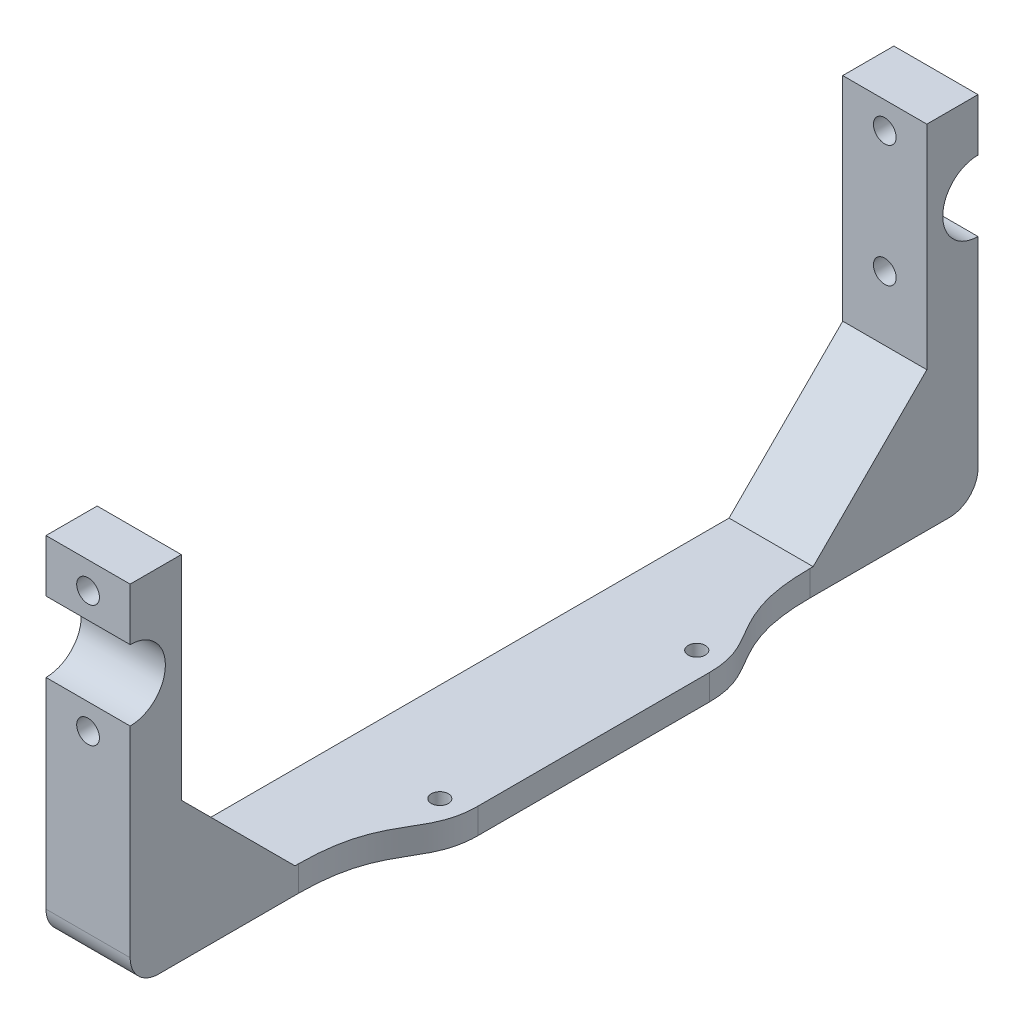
ISO-10303-21;
HEADER;
FILE_DESCRIPTION(('STEP AP214'),'2;1');
FILE_NAME('part.step','',(''),(''),'','','');
FILE_SCHEMA(('AUTOMOTIVE_DESIGN { 1 0 10303 214 1 1 1 1 }'));
ENDSEC;
DATA;
#1=APPLICATION_CONTEXT('core data for automotive mechanical design processes');
#2=APPLICATION_PROTOCOL_DEFINITION('international standard','automotive_design',2000,#1);
#3=PRODUCT_CONTEXT('',#1,'mechanical');
#4=PRODUCT('Part','Part','',(#3));
#5=PRODUCT_RELATED_PRODUCT_CATEGORY('part','',(#4));
#6=PRODUCT_DEFINITION_FORMATION('','',#4);
#7=PRODUCT_DEFINITION_CONTEXT('part definition',#1,'design');
#8=PRODUCT_DEFINITION('design','',#6,#7);
#9=PRODUCT_DEFINITION_SHAPE('','',#8);
#10=(LENGTH_UNIT() NAMED_UNIT(*) SI_UNIT(.MILLI.,.METRE.));
#11=(NAMED_UNIT(*) PLANE_ANGLE_UNIT() SI_UNIT($,.RADIAN.));
#12=(NAMED_UNIT(*) SI_UNIT($,.STERADIAN.) SOLID_ANGLE_UNIT());
#13=UNCERTAINTY_MEASURE_WITH_UNIT(LENGTH_MEASURE(1.E-05),#10,'distance_accuracy_value','');
#14=(GEOMETRIC_REPRESENTATION_CONTEXT(3) GLOBAL_UNCERTAINTY_ASSIGNED_CONTEXT((#13)) GLOBAL_UNIT_ASSIGNED_CONTEXT((#10,
#11,#12)) REPRESENTATION_CONTEXT('',''));
#15=CARTESIAN_POINT('',(0.,0.,0.));
#16=DIRECTION('',(0.,0.,1.));
#17=DIRECTION('',(1.,0.,0.));
#18=AXIS2_PLACEMENT_3D('',#15,#16,#17);
#19=CARTESIAN_POINT('',(14.8,4.5,90.));
#20=DIRECTION('',(0.,-1.,0.));
#21=DIRECTION('',(0.,0.,-1.));
#22=AXIS2_PLACEMENT_3D('',#19,#20,#21);
#23=PLANE('',#22);
#24=CARTESIAN_POINT('',(17.2994949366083,4.5,-22.6005050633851));
#25=DIRECTION('',(0.,-1.,0.));
#26=DIRECTION('',(0.,0.,-1.));
#27=AXIS2_PLACEMENT_3D('',#24,#25,#26);
#28=CIRCLE('',#27,1.50000000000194);
#29=CARTESIAN_POINT('',(17.2994949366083,4.5,-24.100505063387));
#30=VERTEX_POINT('',#29);
#31=EDGE_CURVE('E322',#30,#30,#28,.T.);
#32=ORIENTED_EDGE('',*,*,#31,.T.);
#33=EDGE_LOOP('',(#32));
#34=FACE_BOUND('',#33,.T.);
#35=CARTESIAN_POINT('',(17.2994949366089,4.5,22.6005050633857));
#36=DIRECTION('',(0.,-1.,0.));
#37=DIRECTION('',(0.,0.,-1.));
#38=AXIS2_PLACEMENT_3D('',#35,#36,#37);
#39=CIRCLE('',#38,1.50000000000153);
#40=CARTESIAN_POINT('',(17.2994949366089,4.5,21.1005050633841));
#41=VERTEX_POINT('',#40);
#42=EDGE_CURVE('E332',#41,#41,#39,.T.);
#43=ORIENTED_EDGE('',*,*,#42,.T.);
#44=EDGE_LOOP('',(#43));
#45=FACE_BOUND('',#44,.T.);
#46=DIRECTION('',(0.,0.,1.));
#47=VECTOR('',#46,1.);
#48=CARTESIAN_POINT('',(0.,4.5,90.));
#49=LINE('',#48,#47);
#50=CARTESIAN_POINT('',(0.,4.5,-45.579));
#51=VERTEX_POINT('',#50);
#52=CARTESIAN_POINT('',(0.,4.5,45.5789999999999));
#53=VERTEX_POINT('',#52);
#54=EDGE_CURVE('E346',#51,#53,#49,.T.);
#55=ORIENTED_EDGE('',*,*,#54,.T.);
#56=DIRECTION('',(1.,0.,0.));
#57=VECTOR('',#56,1.);
#58=CARTESIAN_POINT('',(14.8,4.5,45.5789999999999));
#59=LINE('',#58,#57);
#60=CARTESIAN_POINT('',(14.8,4.5,45.5789999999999));
#61=VERTEX_POINT('',#60);
#62=EDGE_CURVE('E366',#53,#61,#59,.T.);
#63=ORIENTED_EDGE('',*,*,#62,.T.);
#64=DIRECTION('',(0.,0.,1.));
#65=VECTOR('',#64,1.);
#66=CARTESIAN_POINT('',(14.8,4.5,90.));
#67=LINE('',#66,#65);
#68=CARTESIAN_POINT('',(14.8,4.5,45.));
#69=VERTEX_POINT('',#68);
#70=EDGE_CURVE('E354',#69,#61,#67,.T.);
#71=ORIENTED_EDGE('',*,*,#70,.F.);
#72=CARTESIAN_POINT('',(14.8,4.50000000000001,45.));
#73=CARTESIAN_POINT('',(14.8,4.50000000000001,29.7858355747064));
#74=CARTESIAN_POINT('',(21.8,4.50000000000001,29.7858355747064));
#75=CARTESIAN_POINT('',(21.8,4.50000000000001,20.3664277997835));
#76=B_SPLINE_CURVE_WITH_KNOTS('',3,(#72,#73,#74,#75),.UNSPECIFIED.,.F.,.F.,(4,4),(0.,1.),.UNSPECIFIED.);
#77=CARTESIAN_POINT('',(21.8,4.5,20.3664277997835));
#78=VERTEX_POINT('',#77);
#79=EDGE_CURVE('E309',#69,#78,#76,.T.);
#80=ORIENTED_EDGE('',*,*,#79,.T.);
#81=DIRECTION('',(0.,0.,1.));
#82=VECTOR('',#81,1.);
#83=CARTESIAN_POINT('',(21.8,4.5,45.));
#84=LINE('',#83,#82);
#85=CARTESIAN_POINT('',(21.8,4.5,-20.3664277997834));
#86=VERTEX_POINT('',#85);
#87=EDGE_CURVE('E339',#86,#78,#84,.T.);
#88=ORIENTED_EDGE('',*,*,#87,.F.);
#89=CARTESIAN_POINT('',(21.8,4.50000000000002,-20.3664277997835));
#90=CARTESIAN_POINT('',(21.8,4.50000000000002,-29.7858355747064));
#91=CARTESIAN_POINT('',(14.8,4.50000000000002,-29.7858355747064));
#92=CARTESIAN_POINT('',(14.8,4.50000000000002,-45.));
#93=B_SPLINE_CURVE_WITH_KNOTS('',3,(#89,#90,#91,#92),.UNSPECIFIED.,.F.,.F.,(4,4),(0.,1.),.UNSPECIFIED.);
#94=CARTESIAN_POINT('',(14.8,4.5,-45.));
#95=VERTEX_POINT('',#94);
#96=EDGE_CURVE('E312',#86,#95,#93,.T.);
#97=ORIENTED_EDGE('',*,*,#96,.T.);
#98=CARTESIAN_POINT('',(14.8,4.5,-45.579));
#99=VERTEX_POINT('',#98);
#100=EDGE_CURVE('E358',#99,#95,#67,.T.);
#101=ORIENTED_EDGE('',*,*,#100,.F.);
#102=DIRECTION('',(-1.,0.,0.));
#103=VECTOR('',#102,1.);
#104=CARTESIAN_POINT('',(14.8,4.5,-45.5790000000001));
#105=LINE('',#104,#103);
#106=EDGE_CURVE('E364',#99,#51,#105,.T.);
#107=ORIENTED_EDGE('',*,*,#106,.T.);
#108=EDGE_LOOP('',(#55,#63,#71,#80,#88,#97,#101,#107));
#109=FACE_BOUND('',#108,.T.);
#110=ADVANCED_FACE('F37',(#34,#45,#109),#23,.F.);
#111=CARTESIAN_POINT('',(14.8,0.,0.));
#112=DIRECTION('',(-1.,0.,0.));
#113=DIRECTION('',(0.,0.,1.));
#114=AXIS2_PLACEMENT_3D('',#111,#112,#113);
#115=PLANE('',#114);
#116=DIRECTION('',(0.,-1.,0.));
#117=VECTOR('',#116,1.);
#118=CARTESIAN_POINT('',(14.8,40.3,74.579));
#119=LINE('',#118,#117);
#120=CARTESIAN_POINT('',(14.8,40.3,74.579));
#121=VERTEX_POINT('',#120);
#122=CARTESIAN_POINT('',(14.8,5.,74.579));
#123=VERTEX_POINT('',#122);
#124=EDGE_CURVE('E181',#121,#123,#119,.T.);
#125=ORIENTED_EDGE('',*,*,#124,.T.);
#126=CARTESIAN_POINT('',(14.8,5.,69.579));
#127=DIRECTION('',(-1.,0.,0.));
#128=DIRECTION('',(0.,0.,1.));
#129=AXIS2_PLACEMENT_3D('',#126,#127,#128);
#130=CIRCLE('',#129,5.);
#131=CARTESIAN_POINT('',(14.8,0.,69.579));
#132=VERTEX_POINT('',#131);
#133=EDGE_CURVE('E422',#123,#132,#130,.F.);
#134=ORIENTED_EDGE('',*,*,#133,.T.);
#135=DIRECTION('',(0.,0.,1.));
#136=VECTOR('',#135,1.);
#137=CARTESIAN_POINT('',(14.8,0.,90.));
#138=LINE('',#137,#136);
#139=CARTESIAN_POINT('',(14.8,0.,45.));
#140=VERTEX_POINT('',#139);
#141=EDGE_CURVE('E343',#140,#132,#138,.T.);
#142=ORIENTED_EDGE('',*,*,#141,.F.);
#143=DIRECTION('',(0.,-1.,0.));
#144=VECTOR('',#143,1.);
#145=CARTESIAN_POINT('',(14.8,0.,45.));
#146=LINE('',#145,#144);
#147=EDGE_CURVE('E340',#69,#140,#146,.T.);
#148=ORIENTED_EDGE('',*,*,#147,.F.);
#149=ORIENTED_EDGE('',*,*,#70,.T.);
#150=DIRECTION('',(0.,0.707106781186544,0.707106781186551));
#151=VECTOR('',#150,1.);
#152=CARTESIAN_POINT('',(14.8,-20.5394999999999,20.5394999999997));
#153=LINE('',#152,#151);
#154=CARTESIAN_POINT('',(14.8,24.4999999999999,65.579));
#155=VERTEX_POINT('',#154);
#156=EDGE_CURVE('E373',#61,#155,#153,.T.);
#157=ORIENTED_EDGE('',*,*,#156,.T.);
#158=DIRECTION('',(0.,1.,0.));
#159=VECTOR('',#158,1.);
#160=CARTESIAN_POINT('',(14.8,46.5,65.579));
#161=LINE('',#160,#159);
#162=CARTESIAN_POINT('',(14.8,61.92,65.579));
#163=VERTEX_POINT('',#162);
#164=EDGE_CURVE('E217',#155,#163,#161,.T.);
#165=ORIENTED_EDGE('',*,*,#164,.T.);
#166=DIRECTION('',(0.,0.,1.));
#167=VECTOR('',#166,1.);
#168=CARTESIAN_POINT('',(14.8,61.92,74.579));
#169=LINE('',#168,#167);
#170=CARTESIAN_POINT('',(14.8,61.92,74.579));
#171=VERTEX_POINT('',#170);
#172=EDGE_CURVE('E203',#163,#171,#169,.T.);
#173=ORIENTED_EDGE('',*,*,#172,.T.);
#174=DIRECTION('',(0.,-1.,0.));
#175=VECTOR('',#174,1.);
#176=CARTESIAN_POINT('',(14.8,52.7,74.579));
#177=LINE('',#176,#175);
#178=CARTESIAN_POINT('',(14.8,52.7,74.579));
#179=VERTEX_POINT('',#178);
#180=EDGE_CURVE('E200',#171,#179,#177,.T.);
#181=ORIENTED_EDGE('',*,*,#180,.T.);
#182=CARTESIAN_POINT('',(14.8,46.5,74.579));
#183=DIRECTION('',(-1.,0.,0.));
#184=DIRECTION('',(0.,0.,1.));
#185=AXIS2_PLACEMENT_3D('',#182,#183,#184);
#186=CIRCLE('',#185,6.19999999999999);
#187=EDGE_CURVE('E214',#179,#121,#186,.T.);
#188=ORIENTED_EDGE('',*,*,#187,.T.);
#189=EDGE_LOOP('',(#125,#134,#142,#148,#149,#157,#165,#173,#181,#188));
#190=FACE_BOUND('',#189,.T.);
#191=ADVANCED_FACE('F454',(#190),#115,.F.);
#192=CARTESIAN_POINT('',(14.8,0.,-69.5789999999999));
#193=VERTEX_POINT('',#192);
#194=CARTESIAN_POINT('',(14.8,0.,-45.));
#195=VERTEX_POINT('',#194);
#196=EDGE_CURVE('E347',#193,#195,#138,.T.);
#197=ORIENTED_EDGE('',*,*,#196,.F.);
#198=CARTESIAN_POINT('',(14.8,5.00000000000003,-69.579));
#199=DIRECTION('',(-1.,0.,0.));
#200=DIRECTION('',(0.,0.,1.));
#201=AXIS2_PLACEMENT_3D('',#198,#199,#200);
#202=CIRCLE('',#201,5.);
#203=CARTESIAN_POINT('',(14.8,5.00000000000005,-74.579));
#204=VERTEX_POINT('',#203);
#205=EDGE_CURVE('E423',#193,#204,#202,.F.);
#206=ORIENTED_EDGE('',*,*,#205,.T.);
#207=DIRECTION('',(0.,1.,0.));
#208=VECTOR('',#207,1.);
#209=CARTESIAN_POINT('',(14.8,40.3,-74.579));
#210=LINE('',#209,#208);
#211=CARTESIAN_POINT('',(14.8,40.3,-74.579));
#212=VERTEX_POINT('',#211);
#213=EDGE_CURVE('E222',#204,#212,#210,.T.);
#214=ORIENTED_EDGE('',*,*,#213,.T.);
#215=CARTESIAN_POINT('',(14.8,46.5,-74.579));
#216=DIRECTION('',(-1.,0.,0.));
#217=DIRECTION('',(0.,0.,-1.));
#218=AXIS2_PLACEMENT_3D('',#215,#216,#217);
#219=CIRCLE('',#218,6.19999999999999);
#220=CARTESIAN_POINT('',(14.8,52.7,-74.579));
#221=VERTEX_POINT('',#220);
#222=EDGE_CURVE('E243',#212,#221,#219,.T.);
#223=ORIENTED_EDGE('',*,*,#222,.T.);
#224=DIRECTION('',(0.,1.,0.));
#225=VECTOR('',#224,1.);
#226=CARTESIAN_POINT('',(14.8,52.7,-74.579));
#227=LINE('',#226,#225);
#228=CARTESIAN_POINT('',(14.8,61.92,-74.579));
#229=VERTEX_POINT('',#228);
#230=EDGE_CURVE('E246',#221,#229,#227,.T.);
#231=ORIENTED_EDGE('',*,*,#230,.T.);
#232=DIRECTION('',(0.,0.,1.));
#233=VECTOR('',#232,1.);
#234=CARTESIAN_POINT('',(14.8,61.92,-74.579));
#235=LINE('',#234,#233);
#236=CARTESIAN_POINT('',(14.8,61.92,-65.579));
#237=VERTEX_POINT('',#236);
#238=EDGE_CURVE('E249',#229,#237,#235,.T.);
#239=ORIENTED_EDGE('',*,*,#238,.T.);
#240=DIRECTION('',(0.,-1.,0.));
#241=VECTOR('',#240,1.);
#242=CARTESIAN_POINT('',(14.8,46.5,-65.579));
#243=LINE('',#242,#241);
#244=CARTESIAN_POINT('',(14.8,24.5000000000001,-65.579));
#245=VERTEX_POINT('',#244);
#246=EDGE_CURVE('E230',#237,#245,#243,.T.);
#247=ORIENTED_EDGE('',*,*,#246,.T.);
#248=DIRECTION('',(0.,-0.707106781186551,0.707106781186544));
#249=VECTOR('',#248,1.);
#250=CARTESIAN_POINT('',(14.8,-20.5395000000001,-20.5395000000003));
#251=LINE('',#250,#249);
#252=EDGE_CURVE('E46',#245,#99,#251,.T.);
#253=ORIENTED_EDGE('',*,*,#252,.T.);
#254=ORIENTED_EDGE('',*,*,#100,.T.);
#255=DIRECTION('',(0.,1.,0.));
#256=VECTOR('',#255,1.);
#257=CARTESIAN_POINT('',(14.8,0.,-45.));
#258=LINE('',#257,#256);
#259=EDGE_CURVE('E335',#195,#95,#258,.T.);
#260=ORIENTED_EDGE('',*,*,#259,.F.);
#261=EDGE_LOOP('',(#197,#206,#214,#223,#231,#239,#247,#253,#254,#260));
#262=FACE_BOUND('',#261,.T.);
#263=ADVANCED_FACE('F379',(#262),#115,.F.);
#264=CARTESIAN_POINT('',(0.,0.,0.));
#265=DIRECTION('',(-1.,0.,0.));
#266=DIRECTION('',(0.,0.,1.));
#267=AXIS2_PLACEMENT_3D('',#264,#265,#266);
#268=PLANE('',#267);
#269=DIRECTION('',(0.,0.,1.));
#270=VECTOR('',#269,1.);
#271=CARTESIAN_POINT('',(0.,0.,90.));
#272=LINE('',#271,#270);
#273=CARTESIAN_POINT('',(0.,0.,-69.5789999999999));
#274=VERTEX_POINT('',#273);
#275=CARTESIAN_POINT('',(0.,0.,69.579));
#276=VERTEX_POINT('',#275);
#277=EDGE_CURVE('E344',#274,#276,#272,.T.);
#278=ORIENTED_EDGE('',*,*,#277,.T.);
#279=CARTESIAN_POINT('',(0.,5.,69.579));
#280=DIRECTION('',(-1.,0.,0.));
#281=DIRECTION('',(0.,0.,1.));
#282=AXIS2_PLACEMENT_3D('',#279,#280,#281);
#283=CIRCLE('',#282,5.);
#284=CARTESIAN_POINT('',(0.,5.,74.579));
#285=VERTEX_POINT('',#284);
#286=EDGE_CURVE('E195',#276,#285,#283,.T.);
#287=ORIENTED_EDGE('',*,*,#286,.T.);
#288=DIRECTION('',(0.,-1.,0.));
#289=VECTOR('',#288,1.);
#290=CARTESIAN_POINT('',(0.,40.3,74.579));
#291=LINE('',#290,#289);
#292=CARTESIAN_POINT('',(0.,40.3,74.579));
#293=VERTEX_POINT('',#292);
#294=EDGE_CURVE('E178',#293,#285,#291,.T.);
#295=ORIENTED_EDGE('',*,*,#294,.F.);
#296=CARTESIAN_POINT('',(0.,46.5,74.579));
#297=DIRECTION('',(-1.,0.,0.));
#298=DIRECTION('',(0.,0.,1.));
#299=AXIS2_PLACEMENT_3D('',#296,#297,#298);
#300=CIRCLE('',#299,6.19999999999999);
#301=CARTESIAN_POINT('',(0.,52.7,74.579));
#302=VERTEX_POINT('',#301);
#303=EDGE_CURVE('E193',#302,#293,#300,.T.);
#304=ORIENTED_EDGE('',*,*,#303,.F.);
#305=DIRECTION('',(0.,-1.,0.));
#306=VECTOR('',#305,1.);
#307=CARTESIAN_POINT('',(0.,52.7,74.579));
#308=LINE('',#307,#306);
#309=CARTESIAN_POINT('',(0.,61.92,74.579));
#310=VERTEX_POINT('',#309);
#311=EDGE_CURVE('E187',#310,#302,#308,.T.);
#312=ORIENTED_EDGE('',*,*,#311,.F.);
#313=DIRECTION('',(0.,0.,1.));
#314=VECTOR('',#313,1.);
#315=CARTESIAN_POINT('',(0.,61.92,74.579));
#316=LINE('',#315,#314);
#317=CARTESIAN_POINT('',(0.,61.92,65.579));
#318=VERTEX_POINT('',#317);
#319=EDGE_CURVE('E210',#318,#310,#316,.T.);
#320=ORIENTED_EDGE('',*,*,#319,.F.);
#321=DIRECTION('',(0.,1.,0.));
#322=VECTOR('',#321,1.);
#323=CARTESIAN_POINT('',(0.,46.5,65.579));
#324=LINE('',#323,#322);
#325=CARTESIAN_POINT('',(0.,24.4999999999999,65.579));
#326=VERTEX_POINT('',#325);
#327=EDGE_CURVE('E196',#326,#318,#324,.T.);
#328=ORIENTED_EDGE('',*,*,#327,.F.);
#329=DIRECTION('',(0.,-0.707106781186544,-0.707106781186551));
#330=VECTOR('',#329,1.);
#331=CARTESIAN_POINT('',(0.,4.5,45.5789999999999));
#332=LINE('',#331,#330);
#333=EDGE_CURVE('E375',#326,#53,#332,.T.);
#334=ORIENTED_EDGE('',*,*,#333,.T.);
#335=ORIENTED_EDGE('',*,*,#54,.F.);
#336=DIRECTION('',(0.,0.707106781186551,-0.707106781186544));
#337=VECTOR('',#336,1.);
#338=CARTESIAN_POINT('',(0.,24.5000000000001,-65.579));
#339=LINE('',#338,#337);
#340=CARTESIAN_POINT('',(0.,24.5000000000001,-65.579));
#341=VERTEX_POINT('',#340);
#342=EDGE_CURVE('E11',#51,#341,#339,.T.);
#343=ORIENTED_EDGE('',*,*,#342,.T.);
#344=DIRECTION('',(0.,-1.,0.));
#345=VECTOR('',#344,1.);
#346=CARTESIAN_POINT('',(0.,46.5,-65.579));
#347=LINE('',#346,#345);
#348=CARTESIAN_POINT('',(0.,61.92,-65.579));
#349=VERTEX_POINT('',#348);
#350=EDGE_CURVE('E239',#349,#341,#347,.T.);
#351=ORIENTED_EDGE('',*,*,#350,.F.);
#352=DIRECTION('',(0.,0.,1.));
#353=VECTOR('',#352,1.);
#354=CARTESIAN_POINT('',(0.,61.92,-74.579));
#355=LINE('',#354,#353);
#356=CARTESIAN_POINT('',(0.,61.92,-74.579));
#357=VERTEX_POINT('',#356);
#358=EDGE_CURVE('E236',#357,#349,#355,.T.);
#359=ORIENTED_EDGE('',*,*,#358,.F.);
#360=DIRECTION('',(0.,1.,0.));
#361=VECTOR('',#360,1.);
#362=CARTESIAN_POINT('',(0.,52.7,-74.579));
#363=LINE('',#362,#361);
#364=CARTESIAN_POINT('',(0.,52.7,-74.579));
#365=VERTEX_POINT('',#364);
#366=EDGE_CURVE('E233',#365,#357,#363,.T.);
#367=ORIENTED_EDGE('',*,*,#366,.F.);
#368=CARTESIAN_POINT('',(0.,46.5,-74.579));
#369=DIRECTION('',(-1.,0.,0.));
#370=DIRECTION('',(0.,0.,-1.));
#371=AXIS2_PLACEMENT_3D('',#368,#369,#370);
#372=CIRCLE('',#371,6.19999999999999);
#373=CARTESIAN_POINT('',(0.,40.3,-74.579));
#374=VERTEX_POINT('',#373);
#375=EDGE_CURVE('E229',#374,#365,#372,.T.);
#376=ORIENTED_EDGE('',*,*,#375,.F.);
#377=DIRECTION('',(0.,1.,0.));
#378=VECTOR('',#377,1.);
#379=CARTESIAN_POINT('',(0.,40.3,-74.579));
#380=LINE('',#379,#378);
#381=CARTESIAN_POINT('',(0.,5.00000000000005,-74.579));
#382=VERTEX_POINT('',#381);
#383=EDGE_CURVE('E227',#382,#374,#380,.T.);
#384=ORIENTED_EDGE('',*,*,#383,.F.);
#385=CARTESIAN_POINT('',(0.,5.00000000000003,-69.579));
#386=DIRECTION('',(-1.,0.,0.));
#387=DIRECTION('',(0.,0.,1.));
#388=AXIS2_PLACEMENT_3D('',#385,#386,#387);
#389=CIRCLE('',#388,5.);
#390=EDGE_CURVE('E406',#382,#274,#389,.T.);
#391=ORIENTED_EDGE('',*,*,#390,.T.);
#392=EDGE_LOOP('',(#278,#287,#295,#304,#312,#320,#328,#334,#335,#343,#351,#359,#367,#376,#384,#391));
#393=FACE_BOUND('',#392,.T.);
#394=ADVANCED_FACE('F191',(#393),#268,.T.);
#395=CARTESIAN_POINT('',(0.,0.,90.));
#396=DIRECTION('',(0.,1.,0.));
#397=DIRECTION('',(0.,0.,1.));
#398=AXIS2_PLACEMENT_3D('',#395,#396,#397);
#399=PLANE('',#398);
#400=CARTESIAN_POINT('',(17.2994949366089,0.,22.6005050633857));
#401=DIRECTION('',(0.,-1.,0.));
#402=DIRECTION('',(0.,0.,1.));
#403=AXIS2_PLACEMENT_3D('',#400,#401,#402);
#404=CIRCLE('',#403,1.50000000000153);
#405=CARTESIAN_POINT('',(17.2994949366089,0.,24.1005050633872));
#406=VERTEX_POINT('',#405);
#407=EDGE_CURVE('E257',#406,#406,#404,.T.);
#408=ORIENTED_EDGE('',*,*,#407,.F.);
#409=EDGE_LOOP('',(#408));
#410=FACE_BOUND('',#409,.T.);
#411=CARTESIAN_POINT('',(17.2994949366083,0.,-22.6005050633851));
#412=DIRECTION('',(0.,-1.,0.));
#413=DIRECTION('',(0.,0.,-1.));
#414=AXIS2_PLACEMENT_3D('',#411,#412,#413);
#415=CIRCLE('',#414,1.50000000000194);
#416=CARTESIAN_POINT('',(17.2994949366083,0.,-24.100505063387));
#417=VERTEX_POINT('',#416);
#418=EDGE_CURVE('E303',#417,#417,#415,.T.);
#419=ORIENTED_EDGE('',*,*,#418,.F.);
#420=EDGE_LOOP('',(#419));
#421=FACE_BOUND('',#420,.T.);
#422=ORIENTED_EDGE('',*,*,#141,.T.);
#423=DIRECTION('',(-1.,0.,0.));
#424=VECTOR('',#423,1.);
#425=CARTESIAN_POINT('',(0.,0.,69.579));
#426=LINE('',#425,#424);
#427=EDGE_CURVE('E413',#132,#276,#426,.T.);
#428=ORIENTED_EDGE('',*,*,#427,.T.);
#429=ORIENTED_EDGE('',*,*,#277,.F.);
#430=DIRECTION('',(1.,0.,0.));
#431=VECTOR('',#430,1.);
#432=CARTESIAN_POINT('',(14.8,0.,-69.579));
#433=LINE('',#432,#431);
#434=EDGE_CURVE('E412',#274,#193,#433,.T.);
#435=ORIENTED_EDGE('',*,*,#434,.T.);
#436=ORIENTED_EDGE('',*,*,#196,.T.);
#437=CARTESIAN_POINT('',(21.8,0.,-20.3664277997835));
#438=CARTESIAN_POINT('',(21.8,0.,-29.7858355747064));
#439=CARTESIAN_POINT('',(14.8,0.,-29.7858355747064));
#440=CARTESIAN_POINT('',(14.8,0.,-45.));
#441=B_SPLINE_CURVE_WITH_KNOTS('',3,(#437,#438,#439,#440),.UNSPECIFIED.,.F.,.F.,(4,4),(0.,1.),.UNSPECIFIED.);
#442=CARTESIAN_POINT('',(21.8,0.,-20.3664277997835));
#443=VERTEX_POINT('',#442);
#444=EDGE_CURVE('E271',#443,#195,#441,.T.);
#445=ORIENTED_EDGE('',*,*,#444,.F.);
#446=DIRECTION('',(0.,0.,-1.));
#447=VECTOR('',#446,1.);
#448=CARTESIAN_POINT('',(21.8,0.,-45.));
#449=LINE('',#448,#447);
#450=CARTESIAN_POINT('',(21.8,0.,20.3664277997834));
#451=VERTEX_POINT('',#450);
#452=EDGE_CURVE('E336',#451,#443,#449,.T.);
#453=ORIENTED_EDGE('',*,*,#452,.F.);
#454=CARTESIAN_POINT('',(14.8,0.,45.));
#455=CARTESIAN_POINT('',(14.8,0.,29.7858355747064));
#456=CARTESIAN_POINT('',(21.8,0.,29.7858355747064));
#457=CARTESIAN_POINT('',(21.8,0.,20.3664277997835));
#458=B_SPLINE_CURVE_WITH_KNOTS('',3,(#454,#455,#456,#457),.UNSPECIFIED.,.F.,.F.,(4,4),(0.,1.),.UNSPECIFIED.);
#459=EDGE_CURVE('E266',#140,#451,#458,.T.);
#460=ORIENTED_EDGE('',*,*,#459,.F.);
#461=EDGE_LOOP('',(#422,#428,#429,#435,#436,#445,#453,#460));
#462=FACE_BOUND('',#461,.T.);
#463=ADVANCED_FACE('F426',(#410,#421,#462),#399,.F.);
#464=CARTESIAN_POINT('',(21.8,0.,0.));
#465=DIRECTION('',(-1.,0.,0.));
#466=DIRECTION('',(0.,0.,1.));
#467=AXIS2_PLACEMENT_3D('',#464,#465,#466);
#468=PLANE('',#467);
#469=ORIENTED_EDGE('',*,*,#452,.T.);
#470=DIRECTION('',(0.,1.,0.));
#471=VECTOR('',#470,1.);
#472=CARTESIAN_POINT('',(21.8,0.,-20.3664277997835));
#473=LINE('',#472,#471);
#474=EDGE_CURVE('E429',#443,#86,#473,.T.);
#475=ORIENTED_EDGE('',*,*,#474,.T.);
#476=ORIENTED_EDGE('',*,*,#87,.T.);
#477=DIRECTION('',(0.,-1.,0.));
#478=VECTOR('',#477,1.);
#479=CARTESIAN_POINT('',(21.8,8.,20.3664277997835));
#480=LINE('',#479,#478);
#481=EDGE_CURVE('E361',#78,#451,#480,.T.);
#482=ORIENTED_EDGE('',*,*,#481,.T.);
#483=EDGE_LOOP('',(#469,#475,#476,#482));
#484=FACE_BOUND('',#483,.T.);
#485=ADVANCED_FACE('F290',(#484),#468,.F.);
#486=CARTESIAN_POINT('',(14.8,7.99999999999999,45.));
#487=CARTESIAN_POINT('',(14.8,7.99999999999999,29.7858355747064));
#488=CARTESIAN_POINT('',(21.8,7.99999999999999,29.7858355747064));
#489=CARTESIAN_POINT('',(21.8,8.,20.3664277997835));
#490=B_SPLINE_CURVE_WITH_KNOTS('',3,(#486,#487,#488,#489),.UNSPECIFIED.,.F.,.F.,(4,4),(0.,1.),.UNSPECIFIED.);
#491=DIRECTION('',(0.,-1.,0.));
#492=VECTOR('',#491,1.);
#493=SURFACE_OF_LINEAR_EXTRUSION('',#490,#492);
#494=ORIENTED_EDGE('',*,*,#147,.T.);
#495=ORIENTED_EDGE('',*,*,#459,.T.);
#496=ORIENTED_EDGE('',*,*,#481,.F.);
#497=ORIENTED_EDGE('',*,*,#79,.F.);
#498=EDGE_LOOP('',(#494,#495,#496,#497));
#499=FACE_BOUND('',#498,.T.);
#500=ADVANCED_FACE('F284',(#499),#493,.F.);
#501=CARTESIAN_POINT('',(21.8,8.,-20.3664277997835));
#502=CARTESIAN_POINT('',(21.8,8.00000000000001,-29.7858355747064));
#503=CARTESIAN_POINT('',(14.8,8.00000000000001,-29.7858355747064));
#504=CARTESIAN_POINT('',(14.8,8.00000000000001,-45.));
#505=B_SPLINE_CURVE_WITH_KNOTS('',3,(#501,#502,#503,#504),.UNSPECIFIED.,.F.,.F.,(4,4),(0.,1.),.UNSPECIFIED.);
#506=DIRECTION('',(0.,-1.,0.));
#507=VECTOR('',#506,1.);
#508=SURFACE_OF_LINEAR_EXTRUSION('',#505,#507);
#509=ORIENTED_EDGE('',*,*,#474,.F.);
#510=ORIENTED_EDGE('',*,*,#444,.T.);
#511=ORIENTED_EDGE('',*,*,#259,.T.);
#512=ORIENTED_EDGE('',*,*,#96,.F.);
#513=EDGE_LOOP('',(#509,#510,#511,#512));
#514=FACE_BOUND('',#513,.T.);
#515=ADVANCED_FACE('F279',(#514),#508,.F.);
#516=CARTESIAN_POINT('',(17.2994949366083,8.,-22.6005050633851));
#517=DIRECTION('',(0.,-1.,0.));
#518=DIRECTION('',(0.,0.,-1.));
#519=AXIS2_PLACEMENT_3D('',#516,#517,#518);
#520=CYLINDRICAL_SURFACE('',#519,1.50000000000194);
#521=ORIENTED_EDGE('',*,*,#418,.T.);
#522=EDGE_LOOP('',(#521));
#523=FACE_BOUND('',#522,.T.);
#524=ORIENTED_EDGE('',*,*,#31,.F.);
#525=EDGE_LOOP('',(#524));
#526=FACE_BOUND('',#525,.T.);
#527=ADVANCED_FACE('F283',(#523,#526),#520,.F.);
#528=CARTESIAN_POINT('',(17.2994949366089,8.,22.6005050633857));
#529=DIRECTION('',(0.,-1.,0.));
#530=DIRECTION('',(0.,0.,-1.));
#531=AXIS2_PLACEMENT_3D('',#528,#529,#530);
#532=CYLINDRICAL_SURFACE('',#531,1.50000000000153);
#533=ORIENTED_EDGE('',*,*,#407,.T.);
#534=EDGE_LOOP('',(#533));
#535=FACE_BOUND('',#534,.T.);
#536=ORIENTED_EDGE('',*,*,#42,.F.);
#537=EDGE_LOOP('',(#536));
#538=FACE_BOUND('',#537,.T.);
#539=ADVANCED_FACE('F286',(#535,#538),#532,.F.);
#540=CARTESIAN_POINT('',(0.,46.5,-65.579));
#541=DIRECTION('',(0.,0.,1.));
#542=DIRECTION('',(0.,-1.,0.));
#543=AXIS2_PLACEMENT_3D('',#540,#541,#542);
#544=PLANE('',#543);
#545=CARTESIAN_POINT('',(7.4,57.2,-65.579));
#546=DIRECTION('',(0.,0.,1.));
#547=DIRECTION('',(0.,-1.,0.));
#548=AXIS2_PLACEMENT_3D('',#545,#546,#547);
#549=CIRCLE('',#548,2.);
#550=CARTESIAN_POINT('',(7.4,55.2,-65.579));
#551=VERTEX_POINT('',#550);
#552=EDGE_CURVE('E206',#551,#551,#549,.T.);
#553=ORIENTED_EDGE('',*,*,#552,.F.);
#554=EDGE_LOOP('',(#553));
#555=FACE_BOUND('',#554,.T.);
#556=CARTESIAN_POINT('',(7.4,35.8,-65.579));
#557=DIRECTION('',(0.,0.,1.));
#558=DIRECTION('',(0.,-1.,0.));
#559=AXIS2_PLACEMENT_3D('',#556,#557,#558);
#560=CIRCLE('',#559,2.);
#561=CARTESIAN_POINT('',(7.4,33.8,-65.579));
#562=VERTEX_POINT('',#561);
#563=EDGE_CURVE('E437',#562,#562,#560,.T.);
#564=ORIENTED_EDGE('',*,*,#563,.F.);
#565=EDGE_LOOP('',(#564));
#566=FACE_BOUND('',#565,.T.);
#567=ORIENTED_EDGE('',*,*,#350,.T.);
#568=DIRECTION('',(1.,0.,0.));
#569=VECTOR('',#568,1.);
#570=CARTESIAN_POINT('',(0.,24.5000000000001,-65.579));
#571=LINE('',#570,#569);
#572=EDGE_CURVE('E371',#341,#245,#571,.T.);
#573=ORIENTED_EDGE('',*,*,#572,.T.);
#574=ORIENTED_EDGE('',*,*,#246,.F.);
#575=DIRECTION('',(1.,0.,0.));
#576=VECTOR('',#575,1.);
#577=CARTESIAN_POINT('',(0.,61.92,-65.579));
#578=LINE('',#577,#576);
#579=EDGE_CURVE('E254',#349,#237,#578,.T.);
#580=ORIENTED_EDGE('',*,*,#579,.F.);
#581=EDGE_LOOP('',(#567,#573,#574,#580));
#582=FACE_BOUND('',#581,.T.);
#583=ADVANCED_FACE('F386',(#555,#566,#582),#544,.T.);
#584=CARTESIAN_POINT('',(0.,61.92,-74.579));
#585=DIRECTION('',(0.,1.,0.));
#586=DIRECTION('',(0.,0.,1.));
#587=AXIS2_PLACEMENT_3D('',#584,#585,#586);
#588=PLANE('',#587);
#589=ORIENTED_EDGE('',*,*,#238,.F.);
#590=DIRECTION('',(1.,0.,0.));
#591=VECTOR('',#590,1.);
#592=CARTESIAN_POINT('',(0.,61.92,-74.579));
#593=LINE('',#592,#591);
#594=EDGE_CURVE('E258',#357,#229,#593,.T.);
#595=ORIENTED_EDGE('',*,*,#594,.F.);
#596=ORIENTED_EDGE('',*,*,#358,.T.);
#597=ORIENTED_EDGE('',*,*,#579,.T.);
#598=EDGE_LOOP('',(#589,#595,#596,#597));
#599=FACE_BOUND('',#598,.T.);
#600=ADVANCED_FACE('F391',(#599),#588,.T.);
#601=CARTESIAN_POINT('',(0.,52.7,-74.579));
#602=DIRECTION('',(0.,0.,-1.));
#603=DIRECTION('',(-1.,0.,0.));
#604=AXIS2_PLACEMENT_3D('',#601,#602,#603);
#605=PLANE('',#604);
#606=CARTESIAN_POINT('',(7.4,57.2,-74.579));
#607=DIRECTION('',(0.,0.,-1.));
#608=DIRECTION('',(-1.,0.,0.));
#609=AXIS2_PLACEMENT_3D('',#606,#607,#608);
#610=CIRCLE('',#609,2.);
#611=CARTESIAN_POINT('',(5.4,57.2,-74.579));
#612=VERTEX_POINT('',#611);
#613=EDGE_CURVE('E533',#612,#612,#610,.T.);
#614=ORIENTED_EDGE('',*,*,#613,.F.);
#615=EDGE_LOOP('',(#614));
#616=FACE_BOUND('',#615,.T.);
#617=ORIENTED_EDGE('',*,*,#230,.F.);
#618=DIRECTION('',(1.,0.,0.));
#619=VECTOR('',#618,1.);
#620=CARTESIAN_POINT('',(0.,52.7,-74.579));
#621=LINE('',#620,#619);
#622=EDGE_CURVE('E260',#365,#221,#621,.T.);
#623=ORIENTED_EDGE('',*,*,#622,.F.);
#624=ORIENTED_EDGE('',*,*,#366,.T.);
#625=ORIENTED_EDGE('',*,*,#594,.T.);
#626=EDGE_LOOP('',(#617,#623,#624,#625));
#627=FACE_BOUND('',#626,.T.);
#628=ADVANCED_FACE('F394',(#616,#627),#605,.T.);
#629=CARTESIAN_POINT('',(0.,46.5,-74.579));
#630=DIRECTION('',(1.,0.,0.));
#631=DIRECTION('',(0.,0.,-1.));
#632=AXIS2_PLACEMENT_3D('',#629,#630,#631);
#633=CYLINDRICAL_SURFACE('',#632,6.19999999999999);
#634=ORIENTED_EDGE('',*,*,#222,.F.);
#635=DIRECTION('',(1.,0.,0.));
#636=VECTOR('',#635,1.);
#637=CARTESIAN_POINT('',(0.,40.3,-74.579));
#638=LINE('',#637,#636);
#639=EDGE_CURVE('E241',#374,#212,#638,.T.);
#640=ORIENTED_EDGE('',*,*,#639,.F.);
#641=ORIENTED_EDGE('',*,*,#375,.T.);
#642=ORIENTED_EDGE('',*,*,#622,.T.);
#643=EDGE_LOOP('',(#634,#640,#641,#642));
#644=FACE_BOUND('',#643,.T.);
#645=ADVANCED_FACE('F400',(#644),#633,.F.);
#646=CARTESIAN_POINT('',(0.,40.3,-74.579));
#647=DIRECTION('',(0.,0.,-1.));
#648=DIRECTION('',(-1.,0.,0.));
#649=AXIS2_PLACEMENT_3D('',#646,#647,#648);
#650=PLANE('',#649);
#651=CARTESIAN_POINT('',(7.4,35.8,-74.579));
#652=DIRECTION('',(0.,0.,-1.));
#653=DIRECTION('',(-1.,0.,0.));
#654=AXIS2_PLACEMENT_3D('',#651,#652,#653);
#655=CIRCLE('',#654,2.);
#656=CARTESIAN_POINT('',(5.4,35.8,-74.579));
#657=VERTEX_POINT('',#656);
#658=EDGE_CURVE('E526',#657,#657,#655,.T.);
#659=ORIENTED_EDGE('',*,*,#658,.F.);
#660=EDGE_LOOP('',(#659));
#661=FACE_BOUND('',#660,.T.);
#662=ORIENTED_EDGE('',*,*,#213,.F.);
#663=DIRECTION('',(1.,0.,0.));
#664=VECTOR('',#663,1.);
#665=CARTESIAN_POINT('',(0.,5.00000000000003,-74.579));
#666=LINE('',#665,#664);
#667=EDGE_CURVE('E362',#204,#382,#666,.F.);
#668=ORIENTED_EDGE('',*,*,#667,.T.);
#669=ORIENTED_EDGE('',*,*,#383,.T.);
#670=ORIENTED_EDGE('',*,*,#639,.T.);
#671=EDGE_LOOP('',(#662,#668,#669,#670));
#672=FACE_BOUND('',#671,.T.);
#673=ADVANCED_FACE('F403',(#661,#672),#650,.T.);
#674=CARTESIAN_POINT('',(0.,46.5,74.579));
#675=DIRECTION('',(1.,0.,0.));
#676=DIRECTION('',(0.,0.,-1.));
#677=AXIS2_PLACEMENT_3D('',#674,#675,#676);
#678=CYLINDRICAL_SURFACE('',#677,6.19999999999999);
#679=ORIENTED_EDGE('',*,*,#187,.F.);
#680=DIRECTION('',(1.,0.,0.));
#681=VECTOR('',#680,1.);
#682=CARTESIAN_POINT('',(0.,52.7,74.579));
#683=LINE('',#682,#681);
#684=EDGE_CURVE('E199',#302,#179,#683,.T.);
#685=ORIENTED_EDGE('',*,*,#684,.F.);
#686=ORIENTED_EDGE('',*,*,#303,.T.);
#687=DIRECTION('',(1.,0.,0.));
#688=VECTOR('',#687,1.);
#689=CARTESIAN_POINT('',(0.,40.3,74.579));
#690=LINE('',#689,#688);
#691=EDGE_CURVE('E175',#293,#121,#690,.T.);
#692=ORIENTED_EDGE('',*,*,#691,.T.);
#693=EDGE_LOOP('',(#679,#685,#686,#692));
#694=FACE_BOUND('',#693,.T.);
#695=ADVANCED_FACE('F198',(#694),#678,.F.);
#696=CARTESIAN_POINT('',(0.,52.7,74.579));
#697=DIRECTION('',(0.,0.,1.));
#698=DIRECTION('',(1.,0.,0.));
#699=AXIS2_PLACEMENT_3D('',#696,#697,#698);
#700=PLANE('',#699);
#701=CARTESIAN_POINT('',(7.4,57.2,74.579));
#702=DIRECTION('',(0.,0.,1.));
#703=DIRECTION('',(1.,0.,0.));
#704=AXIS2_PLACEMENT_3D('',#701,#702,#703);
#705=CIRCLE('',#704,2.);
#706=CARTESIAN_POINT('',(9.4,57.2,74.579));
#707=VERTEX_POINT('',#706);
#708=EDGE_CURVE('E436',#707,#707,#705,.T.);
#709=ORIENTED_EDGE('',*,*,#708,.F.);
#710=EDGE_LOOP('',(#709));
#711=FACE_BOUND('',#710,.T.);
#712=ORIENTED_EDGE('',*,*,#180,.F.);
#713=DIRECTION('',(1.,0.,0.));
#714=VECTOR('',#713,1.);
#715=CARTESIAN_POINT('',(0.,61.92,74.579));
#716=LINE('',#715,#714);
#717=EDGE_CURVE('E223',#310,#171,#716,.T.);
#718=ORIENTED_EDGE('',*,*,#717,.F.);
#719=ORIENTED_EDGE('',*,*,#311,.T.);
#720=ORIENTED_EDGE('',*,*,#684,.T.);
#721=EDGE_LOOP('',(#712,#718,#719,#720));
#722=FACE_BOUND('',#721,.T.);
#723=ADVANCED_FACE('F462',(#711,#722),#700,.T.);
#724=CARTESIAN_POINT('',(0.,61.92,74.579));
#725=DIRECTION('',(0.,1.,0.));
#726=DIRECTION('',(0.,0.,1.));
#727=AXIS2_PLACEMENT_3D('',#724,#725,#726);
#728=PLANE('',#727);
#729=ORIENTED_EDGE('',*,*,#172,.F.);
#730=DIRECTION('',(1.,0.,0.));
#731=VECTOR('',#730,1.);
#732=CARTESIAN_POINT('',(0.,61.92,65.579));
#733=LINE('',#732,#731);
#734=EDGE_CURVE('E186',#318,#163,#733,.T.);
#735=ORIENTED_EDGE('',*,*,#734,.F.);
#736=ORIENTED_EDGE('',*,*,#319,.T.);
#737=ORIENTED_EDGE('',*,*,#717,.T.);
#738=EDGE_LOOP('',(#729,#735,#736,#737));
#739=FACE_BOUND('',#738,.T.);
#740=ADVANCED_FACE('F468',(#739),#728,.T.);
#741=CARTESIAN_POINT('',(0.,46.5,65.579));
#742=DIRECTION('',(0.,0.,-1.));
#743=DIRECTION('',(-1.,0.,0.));
#744=AXIS2_PLACEMENT_3D('',#741,#742,#743);
#745=PLANE('',#744);
#746=CARTESIAN_POINT('',(7.4,57.2,65.579));
#747=DIRECTION('',(0.,0.,-1.));
#748=DIRECTION('',(-1.,0.,0.));
#749=AXIS2_PLACEMENT_3D('',#746,#747,#748);
#750=CIRCLE('',#749,2.);
#751=CARTESIAN_POINT('',(5.4,57.2,65.579));
#752=VERTEX_POINT('',#751);
#753=EDGE_CURVE('E433',#752,#752,#750,.T.);
#754=ORIENTED_EDGE('',*,*,#753,.F.);
#755=EDGE_LOOP('',(#754));
#756=FACE_BOUND('',#755,.T.);
#757=CARTESIAN_POINT('',(7.4,35.8,65.579));
#758=DIRECTION('',(0.,0.,-1.));
#759=DIRECTION('',(-1.,0.,0.));
#760=AXIS2_PLACEMENT_3D('',#757,#758,#759);
#761=CIRCLE('',#760,2.);
#762=CARTESIAN_POINT('',(5.4,35.8,65.579));
#763=VERTEX_POINT('',#762);
#764=EDGE_CURVE('E441',#763,#763,#761,.T.);
#765=ORIENTED_EDGE('',*,*,#764,.F.);
#766=EDGE_LOOP('',(#765));
#767=FACE_BOUND('',#766,.T.);
#768=ORIENTED_EDGE('',*,*,#164,.F.);
#769=DIRECTION('',(-1.,0.,0.));
#770=VECTOR('',#769,1.);
#771=CARTESIAN_POINT('',(0.,24.4999999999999,65.579));
#772=LINE('',#771,#770);
#773=EDGE_CURVE('E369',#155,#326,#772,.T.);
#774=ORIENTED_EDGE('',*,*,#773,.T.);
#775=ORIENTED_EDGE('',*,*,#327,.T.);
#776=ORIENTED_EDGE('',*,*,#734,.T.);
#777=EDGE_LOOP('',(#768,#774,#775,#776));
#778=FACE_BOUND('',#777,.T.);
#779=ADVANCED_FACE('F471',(#756,#767,#778),#745,.T.);
#780=CARTESIAN_POINT('',(0.,40.3,74.579));
#781=DIRECTION('',(0.,0.,1.));
#782=DIRECTION('',(1.,0.,0.));
#783=AXIS2_PLACEMENT_3D('',#780,#781,#782);
#784=PLANE('',#783);
#785=CARTESIAN_POINT('',(7.4,35.8,74.579));
#786=DIRECTION('',(0.,0.,1.));
#787=DIRECTION('',(1.,0.,0.));
#788=AXIS2_PLACEMENT_3D('',#785,#786,#787);
#789=CIRCLE('',#788,2.);
#790=CARTESIAN_POINT('',(9.4,35.8,74.579));
#791=VERTEX_POINT('',#790);
#792=EDGE_CURVE('E438',#791,#791,#789,.T.);
#793=ORIENTED_EDGE('',*,*,#792,.F.);
#794=EDGE_LOOP('',(#793));
#795=FACE_BOUND('',#794,.T.);
#796=ORIENTED_EDGE('',*,*,#294,.T.);
#797=DIRECTION('',(-1.,0.,0.));
#798=VECTOR('',#797,1.);
#799=CARTESIAN_POINT('',(14.8,5.,74.579));
#800=LINE('',#799,#798);
#801=EDGE_CURVE('E415',#285,#123,#800,.F.);
#802=ORIENTED_EDGE('',*,*,#801,.T.);
#803=ORIENTED_EDGE('',*,*,#124,.F.);
#804=ORIENTED_EDGE('',*,*,#691,.F.);
#805=EDGE_LOOP('',(#796,#802,#803,#804));
#806=FACE_BOUND('',#805,.T.);
#807=ADVANCED_FACE('F177',(#795,#806),#784,.T.);
#808=CARTESIAN_POINT('',(7.4,35.8,-90.));
#809=DIRECTION('',(0.,0.,1.));
#810=DIRECTION('',(1.,0.,0.));
#811=AXIS2_PLACEMENT_3D('',#808,#809,#810);
#812=CYLINDRICAL_SURFACE('',#811,2.);
#813=ORIENTED_EDGE('',*,*,#764,.T.);
#814=EDGE_LOOP('',(#813));
#815=FACE_BOUND('',#814,.T.);
#816=ORIENTED_EDGE('',*,*,#792,.T.);
#817=EDGE_LOOP('',(#816));
#818=FACE_BOUND('',#817,.T.);
#819=ADVANCED_FACE('F507',(#815,#818),#812,.F.);
#820=CARTESIAN_POINT('',(7.4,57.2,-90.));
#821=DIRECTION('',(0.,0.,1.));
#822=DIRECTION('',(1.,0.,0.));
#823=AXIS2_PLACEMENT_3D('',#820,#821,#822);
#824=CYLINDRICAL_SURFACE('',#823,2.);
#825=ORIENTED_EDGE('',*,*,#708,.T.);
#826=EDGE_LOOP('',(#825));
#827=FACE_BOUND('',#826,.T.);
#828=ORIENTED_EDGE('',*,*,#753,.T.);
#829=EDGE_LOOP('',(#828));
#830=FACE_BOUND('',#829,.T.);
#831=ADVANCED_FACE('F501',(#827,#830),#824,.F.);
#832=ORIENTED_EDGE('',*,*,#563,.T.);
#833=EDGE_LOOP('',(#832));
#834=FACE_BOUND('',#833,.T.);
#835=ORIENTED_EDGE('',*,*,#658,.T.);
#836=EDGE_LOOP('',(#835));
#837=FACE_BOUND('',#836,.T.);
#838=ADVANCED_FACE('F498',(#834,#837),#812,.F.);
#839=ORIENTED_EDGE('',*,*,#552,.T.);
#840=EDGE_LOOP('',(#839));
#841=FACE_BOUND('',#840,.T.);
#842=ORIENTED_EDGE('',*,*,#613,.T.);
#843=EDGE_LOOP('',(#842));
#844=FACE_BOUND('',#843,.T.);
#845=ADVANCED_FACE('F494',(#841,#844),#824,.F.);
#846=CARTESIAN_POINT('',(0.,5.,69.579));
#847=DIRECTION('',(1.,0.,0.));
#848=DIRECTION('',(0.,0.,-1.));
#849=AXIS2_PLACEMENT_3D('',#846,#847,#848);
#850=CYLINDRICAL_SURFACE('',#849,5.);
#851=ORIENTED_EDGE('',*,*,#133,.F.);
#852=ORIENTED_EDGE('',*,*,#801,.F.);
#853=ORIENTED_EDGE('',*,*,#286,.F.);
#854=ORIENTED_EDGE('',*,*,#427,.F.);
#855=EDGE_LOOP('',(#851,#852,#853,#854));
#856=FACE_BOUND('',#855,.T.);
#857=ADVANCED_FACE('F458',(#856),#850,.T.);
#858=CARTESIAN_POINT('',(0.,5.00000000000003,-69.579));
#859=DIRECTION('',(-1.,0.,0.));
#860=DIRECTION('',(0.,0.,1.));
#861=AXIS2_PLACEMENT_3D('',#858,#859,#860);
#862=CYLINDRICAL_SURFACE('',#861,5.);
#863=ORIENTED_EDGE('',*,*,#390,.F.);
#864=ORIENTED_EDGE('',*,*,#667,.F.);
#865=ORIENTED_EDGE('',*,*,#205,.F.);
#866=ORIENTED_EDGE('',*,*,#434,.F.);
#867=EDGE_LOOP('',(#863,#864,#865,#866));
#868=FACE_BOUND('',#867,.T.);
#869=ADVANCED_FACE('F410',(#868),#862,.T.);
#870=CARTESIAN_POINT('',(14.8,4.5,45.5789999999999));
#871=DIRECTION('',(0.,-0.707106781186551,0.707106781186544));
#872=DIRECTION('',(1.,0.,0.));
#873=AXIS2_PLACEMENT_3D('',#870,#871,#872);
#874=PLANE('',#873);
#875=ORIENTED_EDGE('',*,*,#333,.F.);
#876=ORIENTED_EDGE('',*,*,#773,.F.);
#877=ORIENTED_EDGE('',*,*,#156,.F.);
#878=ORIENTED_EDGE('',*,*,#62,.F.);
#879=EDGE_LOOP('',(#875,#876,#877,#878));
#880=FACE_BOUND('',#879,.T.);
#881=ADVANCED_FACE('F474',(#880),#874,.F.);
#882=CARTESIAN_POINT('',(0.,24.5000000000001,-65.579));
#883=DIRECTION('',(0.,-0.707106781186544,-0.707106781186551));
#884=DIRECTION('',(1.,0.,0.));
#885=AXIS2_PLACEMENT_3D('',#882,#883,#884);
#886=PLANE('',#885);
#887=ORIENTED_EDGE('',*,*,#342,.F.);
#888=ORIENTED_EDGE('',*,*,#106,.F.);
#889=ORIENTED_EDGE('',*,*,#252,.F.);
#890=ORIENTED_EDGE('',*,*,#572,.F.);
#891=EDGE_LOOP('',(#887,#888,#889,#890));
#892=FACE_BOUND('',#891,.T.);
#893=ADVANCED_FACE('F40',(#892),#886,.F.);
#894=CLOSED_SHELL('',(#110,#191,#263,#394,#463,#485,#500,#515,#527,#539,#583,#600,#628,#645,
#673,#695,#723,#740,#779,#807,#819,#831,#838,#845,#857,#869,#881,#893));
#895=MANIFOLD_SOLID_BREP('B2',#894);
#896=ADVANCED_BREP_SHAPE_REPRESENTATION('',(#18,#895),#14);
#897=SHAPE_DEFINITION_REPRESENTATION(#9,#896);
ENDSEC;
END-ISO-10303-21;
